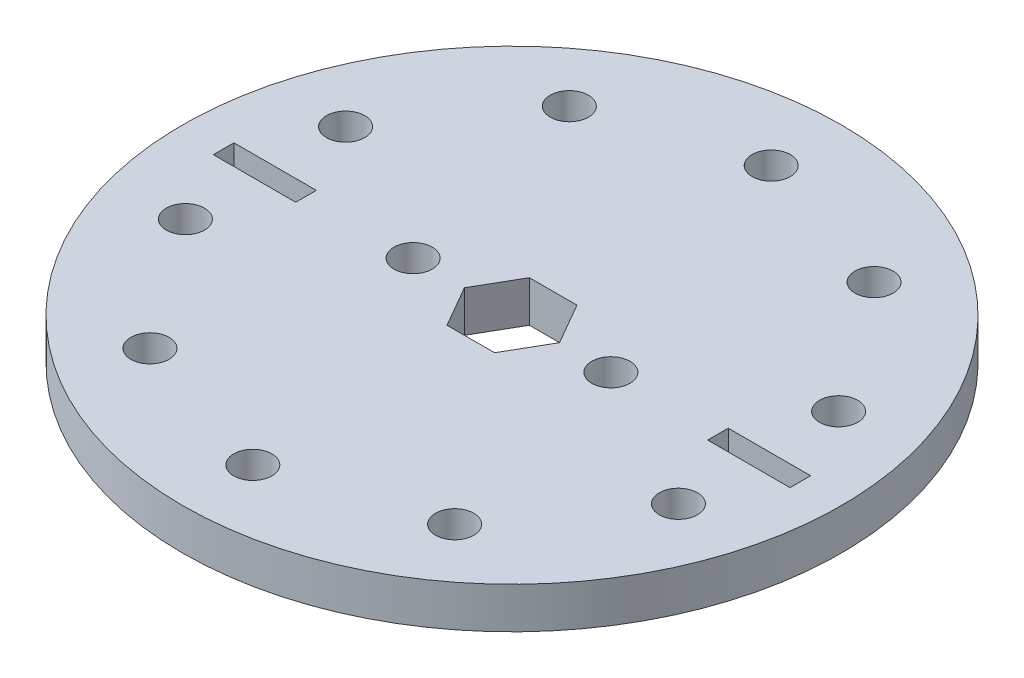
from build123d import *

# Parameters (mm, degrees)
SKETCH1_R             = 25.4
BOSS_EXTRUDE1_DEPTH   = 3.175
F_4_CLEARANCE_HOLE1_D = 2.9464
SKETCH5_W             = 6.35
SKETCH5_H             = 1.5875
CUT_EXTRUDE1_DEPTH    = 37.061067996


with BuildPart() as part:
    # Sketch1 → Boss-Extrude1 (new body)
    with BuildSketch(Plane(origin=(0, 0, 0), x_dir=(1, 0, 0), z_dir=(0, 1, 0))):
        with Locations(Location((0, 0, 0), (0, 0, 270))):
            Circle(SKETCH1_R)
        Polygon((1.833087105, 3.175), (-1.833087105, 3.175), (-3.666174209, 0), (-1.833087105, -3.175), (1.833087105, -3.175), (3.666174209, 0), align=None, mode=Mode.SUBTRACT)
    extrude(amount=BOSS_EXTRUDE1_DEPTH)

    # 4 Clearance Hole1 (through all)
    with Locations(Plane(origin=(0, 3.175, 0), x_dir=(1, 0, 0), z_dir=(0, 1, 0))):
        with Locations((0, 19.977782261), (-11.742645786, 16.162365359), (-19, 6.173474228), (-19, -6.173474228), (-11.742645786, -16.162365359), (0, -19.977782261), (11.742645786, -16.162365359), (19, -6.173474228), (19, 6.173474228), (11.742645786, 16.162365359), (-7.62, 0), (7.62, 0)):
            Hole(F_4_CLEARANCE_HOLE1_D / 2)

    # Sketch5 → Cut-Extrude1 (cut, through all)
    with BuildSketch(Plane(origin=(0, 3.175, 0), x_dir=(1, 0, 0), z_dir=(0, 1, 0))):
        with Locations((19.05, 0)):
            Rectangle(SKETCH5_W, SKETCH5_H)
        with Locations((-19.05, 0)):
            Rectangle(SKETCH5_W, SKETCH5_H)
    extrude(amount=-CUT_EXTRUDE1_DEPTH, mode=Mode.SUBTRACT)


solid = part.part
